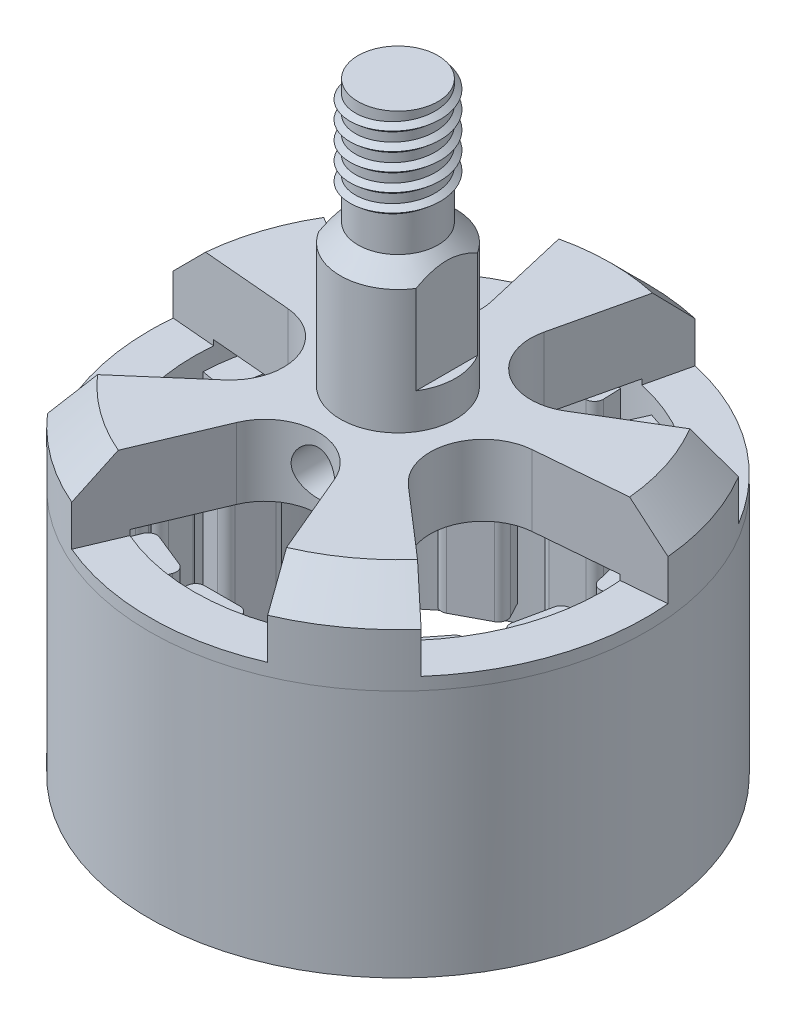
from build123d import *

# Parameters (mm, degrees)
ESQUISSE3_R                         = 11.5
PASSAGE_BOBINES_DEPTH               = 15
REFROIDISSEMENT_BOBINE_DEPTH        = 4.3
R_P_TITION_CIRCULAIRE1_COUNT        = 5
ESQUISSE5_W                         = 0.5
ESQUISSE5_H                         = 10
MEPLAT_DEPTH                        = 13
AIMANT_DEPTH                        = 12.7
REPET_AIMANTS_COUNT                 = 14
REPET_AIMANTS_ANGLE                 = 338
ESQUISSE11_R                        = 1.5
PASSAGE_AXE_DEPTH                   = 6
PASSAGE_VIS_MAINTIEN_AXE_REACH      = 41.345
PASSAGE_VIS_MAINTIEN_AXE_END_RADIUS = 3
ESQUISSE12_R                        = 1.25


with BuildPart() as part:
    # Esquisse2 → rotor brut (revolve)
    with BuildSketch(Plane.XY, mode=Mode.PRIVATE) as rotor_brut_sk:
        Polygon((0, 0), (14, 0), (14, 17), (12, 19), (3.25, 19), (3.25, 26), (2.25, 27), (2.25, 34), (0, 34), align=None)
    revolve(rotor_brut_sk.sketch.rotate(Axis((0, 74.156743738, 0), (0, -1, 0)), 180), axis=Axis((0, 74.156743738, 0), (0, -1, 0)))

    # Esquisse3 → passage bobines (cut)
    with BuildSketch(Plane.XZ):
        Circle(ESQUISSE3_R)
    extrude(amount=-PASSAGE_BOBINES_DEPTH, mode=Mode.SUBTRACT)

    # Esquisse4 → refroidissement bobine (cut)
    with BuildSketch(Plane(origin=(0, 19, 0), x_dir=(1, 0, 0), z_dir=(0, 1, 0))):
        with BuildLine():
            Line((-6, -14), (6, -14))
            Line((6, -14), (2.763863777, -6.333356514))
            ThreePointArc((2.763863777, -6.333356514), (0, -4.5), (-2.763863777, -6.333356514))
            Line((-2.763863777, -6.333356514), (-6, -14))
        make_face()
    refroidissement_bobine = extrude(amount=-REFROIDISSEMENT_BOBINE_DEPTH, mode=Mode.SUBTRACT)

    # R_p_tition circulaire1: refroidissement bobine ×5 about axis
    r_p_tition_circulaire1_axis = Axis((0, 0, 0), (0, 1, 0))
    for i in range(1, R_P_TITION_CIRCULAIRE1_COUNT):
        add(refroidissement_bobine.rotate(r_p_tition_circulaire1_axis, i * 360 / R_P_TITION_CIRCULAIRE1_COUNT), mode=Mode.SUBTRACT)

    # Esquisse5 → meplat (cut)
    with BuildSketch(Plane(origin=(0, 34, 0), x_dir=(-1, 0, 0), z_dir=(0, 1, 0))):
        with Locations((3, 0)):
            Rectangle(ESQUISSE5_W, ESQUISSE5_H)
        with Locations((-3, 0)):
            Rectangle(ESQUISSE5_W, ESQUISSE5_H)
    extrude(amount=-MEPLAT_DEPTH, mode=Mode.SUBTRACT)

    # filetage: sweep along a curve in space
    with BuildLine() as filetage_path:
        add(Edge.make_bspline(
            [(-1.590990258, 34, -1.590990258), (-1.384059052, 33.979299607, -1.797921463), (-0.882850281, 33.937438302, -2.133450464), (-0.000161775, 33.875016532, -2.308414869), (0.883497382, 33.81249557, -2.132890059), (1.632398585, 33.750001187, -1.632398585), (2.132849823, 33.687499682, -0.883457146), (2.308575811, 33.625000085, 8.34e-07), (2.132846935, 33.562499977, 0.883453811), (1.63241014, 33.500000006, 1.63241026), (0.88345405, 33.437499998, 2.132846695), (-4e-09, 33.375, 2.308576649), (-0.883454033, 33.3125, 2.13284671), (-1.632410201, 33.25, 1.632410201), (-2.132846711, 33.1875, 0.883454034), (-2.308576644, 33.125, 0), (-2.132846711, 33.0625, -0.883454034), (-1.6324102, 33, -1.6324102), (-0.883454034, 32.9375, -2.132846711), (0, 32.875, -2.308576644), (0.883454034, 32.8125, -2.132846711), (1.6324102, 32.75, -1.6324102), (2.132846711, 32.6875, -0.883454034), (2.308576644, 32.625, 0), (2.132846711, 32.5625, 0.883454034), (1.6324102, 32.5, 1.6324102), (0.883454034, 32.4375, 2.132846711), (0, 32.375, 2.308576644), (-0.883454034, 32.3125, 2.132846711), (-1.6324102, 32.25, 1.6324102), (-2.132846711, 32.1875, 0.883454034), (-2.308576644, 32.125, 0), (-2.132846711, 32.0625, -0.883454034), (-1.6324102, 32, -1.6324102), (-0.883454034, 31.9375, -2.132846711), (0, 31.875, -2.308576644), (0.883454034, 31.8125, -2.132846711), (1.6324102, 31.75, -1.6324102), (2.132846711, 31.6875, -0.883454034), (2.308576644, 31.625, 0), (2.132846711, 31.5625, 0.883454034), (1.6324102, 31.5, 1.6324102), (0.883454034, 31.4375, 2.132846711), (0, 31.375, 2.308576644), (-0.883454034, 31.3125, 2.132846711), (-1.6324102, 31.25, 1.6324102), (-2.132846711, 31.1875, 0.883454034), (-2.308576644, 31.125, 0), (-2.132846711, 31.0625, -0.883454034), (-1.6324102, 31, -1.6324102), (-0.883454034, 30.9375, -2.132846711), (0, 30.875, -2.308576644), (0.883454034, 30.8125, -2.132846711), (1.6324102, 30.75, -1.6324102), (2.132846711, 30.6875, -0.883454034), (2.308576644, 30.625, 0), (2.132846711, 30.5625, 0.883454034), (1.6324102, 30.5, 1.6324102), (0.883454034, 30.4375, 2.132846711), (0, 30.375, 2.308576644), (-0.883454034, 30.3125, 2.132846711), (-1.6324102, 30.25, 1.6324102), (-2.132846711, 30.1875, 0.883454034), (-2.308576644, 30.125, 0), (-2.132846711, 30.0625, -0.883454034), (-1.6324102, 30, -1.6324102), (-0.883454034, 29.9375, -2.132846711), (0, 29.875, -2.308576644), (0.883454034, 29.8125, -2.132846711), (1.632410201, 29.75, -1.632410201), (2.13284671, 29.6875, -0.883454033), (2.308576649, 29.625, -4e-09), (2.132846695, 29.562500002, 0.88345405), (1.63241026, 29.499999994, 1.63241014), (0.883453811, 29.437500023, 2.132846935), (8.34e-07, 29.374999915, 2.308575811), (-0.883457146, 29.312500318, 2.132849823), (-1.632398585, 29.249998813, 1.632398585), (-2.132890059, 29.18750443, 0.883497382), (-2.308414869, 29.124983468, -0.000161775), (-2.133450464, 29.062561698, -0.882850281), (-1.797921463, 29.020700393, -1.384059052), (-1.590990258, 29, -1.590990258)],
            knots=[0, 0, 0, 0, 0.0125, 0.025, 0.0375, 0.05, 0.0625, 0.075, 0.0875, 0.1, 0.1125, 0.125, 0.1375, 0.15, 0.1625, 0.175, 0.1875, 0.2, 0.2125, 0.225, 0.2375, 0.25, 0.2625, 0.275, 0.2875, 0.3, 0.3125, 0.325, 0.3375, 0.35, 0.3625, 0.375, 0.3875, 0.4, 0.4125, 0.425, 0.4375, 0.45, 0.4625, 0.475, 0.4875, 0.5, 0.5125, 0.525, 0.5375, 0.55, 0.5625, 0.575, 0.5875, 0.6, 0.6125, 0.625, 0.6375, 0.65, 0.6625, 0.675, 0.6875, 0.7, 0.7125, 0.725, 0.7375, 0.75, 0.7625, 0.775, 0.7875, 0.8, 0.8125, 0.825, 0.8375, 0.85, 0.8625, 0.875, 0.8875, 0.9, 0.9125, 0.925, 0.9375, 0.95, 0.9625, 0.975, 0.9875, 1, 1, 1, 1], degree=3))
    # Esquisse7 → filetage (sweep)
    with BuildSketch(Plane.XY):
        Polygon((-2.25, 33.12), (-2.25, 32.62), (-2.55, 32.87), align=None)
    sweep(path=filetage_path.line, is_frenet=True)

    # Esquisse9 → aimant (add)
    with BuildSketch(Plane.XZ.offset(-1)):
        with BuildLine():
            Line((-1.5, 11.401754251), (-1.5, 10.401754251))
            ThreePointArc((-1.5, 10.401754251), (-1.353553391, 10.04820086), (-1, 9.901754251))
            Line((-1, 9.901754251), (1, 9.901754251))
            ThreePointArc((1, 9.901754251), (1.353553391, 10.04820086), (1.5, 10.401754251))
            Line((1.5, 10.401754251), (1.5, 11.401754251))
            ThreePointArc((1.5, 11.401754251), (0, 11.5), (-1.5, 11.401754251))
        make_face()
    aimant = extrude(amount=-AIMANT_DEPTH)

    # repet_ aimants: aimant ×14 about axis
    repet_aimants_axis = Axis((0, 0, 0), (0, 1, 0))
    for i in range(1, REPET_AIMANTS_COUNT):
        add(aimant.rotate(repet_aimants_axis, i * REPET_AIMANTS_ANGLE / (REPET_AIMANTS_COUNT - 1)))

    # Esquisse11 → passage axe (cut)
    with BuildSketch(Plane.XZ.offset(-15)):
        Circle(ESQUISSE11_R)
    extrude(amount=-PASSAGE_AXE_DEPTH, mode=Mode.SUBTRACT)

    # passage vis maintien axe: up to this cylinder (the profile starts outside it)
    passage_vis_maintien_axe_end = Plane(origin=(0, 17, 7.5), z_dir=(0, 1, 0)) * Cylinder(PASSAGE_VIS_MAINTIEN_AXE_END_RADIUS, 89.69, mode=Mode.PRIVATE)
    # Esquisse12 → passage vis maintien axe (cut, up to the surface)
    with BuildSketch(Plane.XY, mode=Mode.PRIVATE) as passage_vis_maintien_axe_sk1:
        with Locations(Location((0, 17, 0), (0, 0, 180))):
            Circle(ESQUISSE12_R)
    passage_vis_maintien_axe_tool1 = extrude(passage_vis_maintien_axe_sk1.sketch, amount=PASSAGE_VIS_MAINTIEN_AXE_REACH, mode=Mode.PRIVATE) - passage_vis_maintien_axe_end
    add(passage_vis_maintien_axe_tool1.solids().sort_by_distance((0, 17, 0))[0], mode=Mode.SUBTRACT)


solid = part.part
